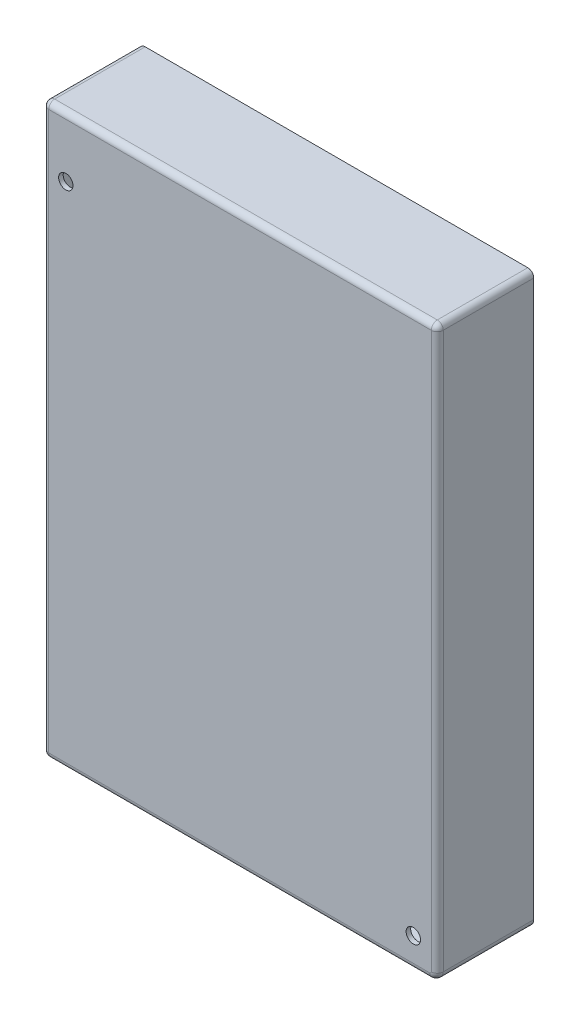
ISO-10303-21;
HEADER;
FILE_DESCRIPTION(('STEP AP214'),'2;1');
FILE_NAME('part.step','',(''),(''),'','','');
FILE_SCHEMA(('AUTOMOTIVE_DESIGN { 1 0 10303 214 1 1 1 1 }'));
ENDSEC;
DATA;
#1=APPLICATION_CONTEXT('core data for automotive mechanical design processes');
#2=APPLICATION_PROTOCOL_DEFINITION('international standard','automotive_design',2000,#1);
#3=PRODUCT_CONTEXT('',#1,'mechanical');
#4=PRODUCT('Part','Part','',(#3));
#5=PRODUCT_RELATED_PRODUCT_CATEGORY('part','',(#4));
#6=PRODUCT_DEFINITION_FORMATION('','',#4);
#7=PRODUCT_DEFINITION_CONTEXT('part definition',#1,'design');
#8=PRODUCT_DEFINITION('design','',#6,#7);
#9=PRODUCT_DEFINITION_SHAPE('','',#8);
#10=(LENGTH_UNIT() NAMED_UNIT(*) SI_UNIT(.MILLI.,.METRE.));
#11=(NAMED_UNIT(*) PLANE_ANGLE_UNIT() SI_UNIT($,.RADIAN.));
#12=(NAMED_UNIT(*) SI_UNIT($,.STERADIAN.) SOLID_ANGLE_UNIT());
#13=UNCERTAINTY_MEASURE_WITH_UNIT(LENGTH_MEASURE(1.E-05),#10,'distance_accuracy_value','');
#14=(GEOMETRIC_REPRESENTATION_CONTEXT(3) GLOBAL_UNCERTAINTY_ASSIGNED_CONTEXT((#13)) GLOBAL_UNIT_ASSIGNED_CONTEXT((#10,
#11,#12)) REPRESENTATION_CONTEXT('',''));
#15=CARTESIAN_POINT('',(0.,0.,0.));
#16=DIRECTION('',(0.,0.,1.));
#17=DIRECTION('',(1.,0.,0.));
#18=AXIS2_PLACEMENT_3D('',#15,#16,#17);
#19=CARTESIAN_POINT('',(-262.047880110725,-138.35456356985,37.759));
#20=DIRECTION('',(1.,0.,0.));
#21=DIRECTION('',(0.,1.,0.));
#22=AXIS2_PLACEMENT_3D('',#19,#20,#21);
#23=SPHERICAL_SURFACE('',#22,2.5);
#24=CARTESIAN_POINT('',(-262.047880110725,-138.35456356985,37.759));
#25=DIRECTION('',(0.,0.,1.));
#26=DIRECTION('',(1.,0.,0.));
#27=AXIS2_PLACEMENT_3D('',#24,#25,#26);
#28=CIRCLE('',#27,2.5);
#29=CARTESIAN_POINT('',(-262.047880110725,-140.85456356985,37.759));
#30=VERTEX_POINT('',#29);
#31=CARTESIAN_POINT('',(-264.547880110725,-138.35456356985,37.759));
#32=VERTEX_POINT('',#31);
#33=EDGE_CURVE('E601',#30,#32,#28,.F.);
#34=ORIENTED_EDGE('',*,*,#33,.F.);
#35=CARTESIAN_POINT('',(-262.047880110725,-138.35456356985,37.759));
#36=DIRECTION('',(-1.,0.,0.));
#37=DIRECTION('',(0.,0.,1.));
#38=AXIS2_PLACEMENT_3D('',#35,#36,#37);
#39=CIRCLE('',#38,2.5);
#40=CARTESIAN_POINT('',(-262.047880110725,-138.35456356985,40.259));
#41=VERTEX_POINT('',#40);
#42=EDGE_CURVE('E599',#41,#30,#39,.F.);
#43=ORIENTED_EDGE('',*,*,#42,.F.);
#44=CARTESIAN_POINT('',(-262.047880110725,-138.35456356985,37.759));
#45=DIRECTION('',(0.,1.,0.));
#46=DIRECTION('',(0.,0.,1.));
#47=AXIS2_PLACEMENT_3D('',#44,#45,#46);
#48=CIRCLE('',#47,2.5);
#49=EDGE_CURVE('E72',#32,#41,#48,.T.);
#50=ORIENTED_EDGE('',*,*,#49,.F.);
#51=EDGE_LOOP('',(#34,#43,#50));
#52=FACE_BOUND('',#51,.T.);
#53=ADVANCED_FACE('F15',(#52),#23,.T.);
#54=CARTESIAN_POINT('',(-103.103844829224,-137.67956356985,37.759));
#55=DIRECTION('',(0.,0.,1.));
#56=DIRECTION('',(0.,-1.,0.));
#57=AXIS2_PLACEMENT_3D('',#54,#55,#56);
#58=DEGENERATE_TOROIDAL_SURFACE('',#57,0.674999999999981,2.50000000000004,.T.);
#59=CARTESIAN_POINT('',(-102.428844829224,-137.67956356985,37.759));
#60=DIRECTION('',(0.,-1.,0.));
#61=DIRECTION('',(1.,0.,0.));
#62=AXIS2_PLACEMENT_3D('',#59,#60,#61);
#63=CIRCLE('',#62,2.5);
#64=CARTESIAN_POINT('',(-102.428844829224,-137.67956356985,40.259));
#65=VERTEX_POINT('',#64);
#66=CARTESIAN_POINT('',(-99.9288448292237,-137.67956356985,37.759));
#67=VERTEX_POINT('',#66);
#68=EDGE_CURVE('E636',#65,#67,#63,.F.);
#69=ORIENTED_EDGE('',*,*,#68,.F.);
#70=CARTESIAN_POINT('',(-103.103844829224,-137.67956356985,40.259));
#71=DIRECTION('',(0.,0.,1.));
#72=DIRECTION('',(0.,-1.,0.));
#73=AXIS2_PLACEMENT_3D('',#70,#71,#72);
#74=CIRCLE('',#73,0.675000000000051);
#75=CARTESIAN_POINT('',(-103.103844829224,-138.35456356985,40.259));
#76=VERTEX_POINT('',#75);
#77=EDGE_CURVE('E22',#65,#76,#74,.F.);
#78=ORIENTED_EDGE('',*,*,#77,.T.);
#79=CARTESIAN_POINT('',(-103.103844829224,-138.35456356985,37.759));
#80=DIRECTION('',(-1.,0.,0.));
#81=DIRECTION('',(0.,0.,1.));
#82=AXIS2_PLACEMENT_3D('',#79,#80,#81);
#83=CIRCLE('',#82,2.5);
#84=CARTESIAN_POINT('',(-103.103844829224,-140.85456356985,37.759));
#85=VERTEX_POINT('',#84);
#86=EDGE_CURVE('E637',#85,#76,#83,.T.);
#87=ORIENTED_EDGE('',*,*,#86,.F.);
#88=CARTESIAN_POINT('',(-103.103844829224,-137.67956356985,37.759));
#89=DIRECTION('',(0.,0.,1.));
#90=DIRECTION('',(1.,0.,0.));
#91=AXIS2_PLACEMENT_3D('',#88,#89,#90);
#92=CIRCLE('',#91,3.175);
#93=EDGE_CURVE('E283',#67,#85,#92,.F.);
#94=ORIENTED_EDGE('',*,*,#93,.F.);
#95=EDGE_LOOP('',(#69,#78,#87,#94));
#96=FACE_BOUND('',#95,.T.);
#97=ADVANCED_FACE('F576',(#96),#58,.T.);
#98=CARTESIAN_POINT('',(-102.42884482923,94.1454364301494,40.259));
#99=CARTESIAN_POINT('',(-102.42884482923,94.1454364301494,40.259));
#100=CARTESIAN_POINT('',(-102.42884482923,94.1454364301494,40.259));
#101=CARTESIAN_POINT('',(-102.42884482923,94.1454364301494,40.259));
#102=CARTESIAN_POINT('',(-102.42884482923,94.1454364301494,40.259));
#103=CARTESIAN_POINT('',(-102.42884482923,94.1454364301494,40.259));
#104=CARTESIAN_POINT('',(-102.42884482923,94.1454364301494,40.259));
#105=CARTESIAN_POINT('',(-102.42884482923,94.1454364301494,40.259));
#106=CARTESIAN_POINT('',(-102.42884482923,94.1454364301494,40.259));
#107=CARTESIAN_POINT('',(-102.42884482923,94.1454364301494,40.259));
#108=CARTESIAN_POINT('',(-102.054845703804,94.1470521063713,40.259000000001));
#109=CARTESIAN_POINT('',(-102.072578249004,94.1647846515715,40.2590000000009));
#110=CARTESIAN_POINT('',(-102.108043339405,94.2002497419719,40.2590000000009));
#111=CARTESIAN_POINT('',(-102.161240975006,94.2534473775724,40.2590000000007));
#112=CARTESIAN_POINT('',(-102.214438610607,94.306645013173,40.2590000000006));
#113=CARTESIAN_POINT('',(-102.267636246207,94.3598426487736,40.2590000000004));
#114=CARTESIAN_POINT('',(-102.320833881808,94.4130402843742,40.2590000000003));
#115=CARTESIAN_POINT('',(-102.374031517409,94.4662379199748,40.2590000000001));
#116=CARTESIAN_POINT('',(-102.409496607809,94.5017030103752,40.2590000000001));
#117=CARTESIAN_POINT('',(-102.42722915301,94.5194355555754,40.259));
#118=CARTESIAN_POINT('',(-101.306951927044,94.1502830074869,40.0882066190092));
#119=CARTESIAN_POINT('',(-101.360317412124,94.2032629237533,40.1059088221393));
#120=CARTESIAN_POINT('',(-101.467110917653,94.3092165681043,40.1360134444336));
#121=CARTESIAN_POINT('',(-101.627226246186,94.4682851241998,40.1658072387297));
#122=CARTESIAN_POINT('',(-101.787131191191,94.6275642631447,40.1806094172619));
#123=CARTESIAN_POINT('',(-101.946706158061,94.787163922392,40.1806099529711));
#124=CARTESIAN_POINT('',(-102.106004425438,94.9470409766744,40.1658066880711));
#125=CARTESIAN_POINT('',(-102.265058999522,95.1071852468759,40.1360139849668));
#126=CARTESIAN_POINT('',(-102.37101887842,95.2139639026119,40.1059087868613));
#127=CARTESIAN_POINT('',(-102.423998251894,95.2673293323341,40.0882066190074));
#128=CARTESIAN_POINT('',(-100.55757465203,94.153520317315,39.490416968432));
#129=CARTESIAN_POINT('',(-100.61230535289,94.2598817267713,39.5493723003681));
#130=CARTESIAN_POINT('',(-100.735613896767,94.4725948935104,39.6518939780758));
#131=CARTESIAN_POINT('',(-100.95743914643,94.7849828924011,39.7562715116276));
#132=CARTESIAN_POINT('',(-101.210925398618,95.0840276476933,39.809013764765));
#133=CARTESIAN_POINT('',(-101.490235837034,95.363378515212,39.8090155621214));
#134=CARTESIAN_POINT('',(-101.789311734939,95.6168191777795,39.7562702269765));
#135=CARTESIAN_POINT('',(-102.101677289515,95.8386917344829,39.6518950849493));
#136=CARTESIAN_POINT('',(-102.314400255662,95.9619759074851,39.5493724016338));
#137=CARTESIAN_POINT('',(-102.420760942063,96.0167066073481,39.4904169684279));
#138=CARTESIAN_POINT('',(-100.15753550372,94.1552484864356,38.852699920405));
#139=CARTESIAN_POINT('',(-100.186236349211,94.3064699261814,38.9154581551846));
#140=CARTESIAN_POINT('',(-100.273180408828,94.608900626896,39.0260016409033));
#141=CARTESIAN_POINT('',(-100.486817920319,95.0450934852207,39.1403664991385));
#142=CARTESIAN_POINT('',(-100.775338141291,95.4469348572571,39.1987020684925));
#143=CARTESIAN_POINT('',(-101.127321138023,95.7989750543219,39.1987048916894));
#144=CARTESIAN_POINT('',(-101.529205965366,96.0874313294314,39.1403647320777));
#145=CARTESIAN_POINT('',(-101.965368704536,96.3011346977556,39.0260029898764));
#146=CARTESIAN_POINT('',(-102.267811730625,96.3880448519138,38.9154584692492));
#147=CARTESIAN_POINT('',(-102.419032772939,96.4167457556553,38.8526999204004));
#148=CARTESIAN_POINT('',(-99.9708912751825,94.1560547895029,38.3200232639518));
#149=CARTESIAN_POINT('',(-99.9777474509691,94.3347209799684,38.3616788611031));
#150=CARTESIAN_POINT('',(-100.030791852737,94.6920410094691,38.4355481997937));
#151=CARTESIAN_POINT('',(-100.224289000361,95.202500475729,38.5126151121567));
#152=CARTESIAN_POINT('',(-100.52257974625,95.6630238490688,38.5521183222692));
#153=CARTESIAN_POINT('',(-100.9112291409,96.0517370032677,38.552120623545));
#154=CARTESIAN_POINT('',(-101.371800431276,96.3499570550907,38.5126137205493));
#155=CARTESIAN_POINT('',(-101.882227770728,96.543526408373,38.4355492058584));
#156=CARTESIAN_POINT('',(-102.239560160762,96.5965337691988,38.3616791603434));
#157=CARTESIAN_POINT('',(-102.418226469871,96.6033899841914,38.3200232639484));
#158=CARTESIAN_POINT('',(-99.9288448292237,94.1562364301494,37.9459995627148));
#159=CARTESIAN_POINT('',(-99.9288448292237,94.3424281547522,37.9599282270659));
#160=CARTESIAN_POINT('',(-99.9708308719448,94.7147956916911,37.984641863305));
#161=CARTESIAN_POINT('',(-100.156425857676,95.2453776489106,38.01044232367));
#162=CARTESIAN_POINT('',(-100.455531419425,95.7212901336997,38.0236726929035));
#163=CARTESIAN_POINT('',(-100.852955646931,96.1187944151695,38.0236732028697));
#164=CARTESIAN_POINT('',(-101.328928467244,96.4178111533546,38.0104420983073));
#165=CARTESIAN_POINT('',(-101.859469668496,96.6034968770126,37.9846419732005));
#166=CARTESIAN_POINT('',(-102.231853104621,96.6454364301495,37.9599283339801));
#167=CARTESIAN_POINT('',(-102.418044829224,96.6454364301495,37.9459995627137));
#168=CARTESIAN_POINT('',(-99.9288448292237,94.1562364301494,37.759));
#169=CARTESIAN_POINT('',(-99.9288448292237,94.3424281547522,37.759));
#170=CARTESIAN_POINT('',(-99.9708308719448,94.7147956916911,37.759));
#171=CARTESIAN_POINT('',(-100.156425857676,95.2453776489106,37.759));
#172=CARTESIAN_POINT('',(-100.455531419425,95.7212901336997,37.759));
#173=CARTESIAN_POINT('',(-100.852955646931,96.1187944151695,37.759));
#174=CARTESIAN_POINT('',(-101.328928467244,96.4178111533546,37.759));
#175=CARTESIAN_POINT('',(-101.859469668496,96.6034968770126,37.759));
#176=CARTESIAN_POINT('',(-102.231853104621,96.6454364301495,37.759));
#177=CARTESIAN_POINT('',(-102.418044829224,96.6454364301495,37.759));
#178=B_SPLINE_SURFACE_WITH_KNOTS('',3,3,((#98,#99,#100,#101,#102,#103,#104,#105,#106,#107),
(#108,#109,#110,#111,#112,#113,#114,#115,#116,#117),(#118,#119,#120,#121,#122,#123,#124,#125,
#126,#127),(#128,#129,#130,#131,#132,#133,#134,#135,#136,#137),(#138,#139,#140,#141,#142,#143,
#144,#145,#146,#147),(#148,#149,#150,#151,#152,#153,#154,#155,#156,#157),(#158,#159,#160,#161,
#162,#163,#164,#165,#166,#167),(#168,#169,#170,#171,#172,#173,#174,#175,#176,#177)),
.UNSPECIFIED.,.F.,.F.,.F.,(4,1,1,1,1,4),(4,1,1,1,1,1,1,4),(-1.57079632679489,-1.12199737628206,
-0.673198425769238,-0.448798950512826,-0.224399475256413,0.),(0.,0.142857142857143,
0.285714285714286,0.428571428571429,0.571428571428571,0.714285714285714,0.857142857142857,1.),.UNSPECIFIED.);
#179=CARTESIAN_POINT('',(-102.418044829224,96.6454364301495,37.759));
#180=CARTESIAN_POINT('',(-102.418044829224,96.6454364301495,37.9459995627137));
#181=CARTESIAN_POINT('',(-102.418226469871,96.6033899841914,38.3200232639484));
#182=CARTESIAN_POINT('',(-102.419032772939,96.4167457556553,38.8526999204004));
#183=CARTESIAN_POINT('',(-102.420760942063,96.0167066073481,39.4904169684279));
#184=CARTESIAN_POINT('',(-102.423998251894,95.2673293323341,40.0882066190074));
#185=CARTESIAN_POINT('',(-102.42722915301,94.5194355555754,40.259));
#186=CARTESIAN_POINT('',(-102.42884482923,94.1454364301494,40.259));
#187=B_SPLINE_CURVE_WITH_KNOTS('',3,(#179,#180,#181,#182,#183,#184,#185,#186),.UNSPECIFIED.,.F.,
.F.,(4,1,1,1,1,4),(-1.57079632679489,-1.34639685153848,-1.12199737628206,-0.897597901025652,
-0.448798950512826,0.),.UNSPECIFIED.);
#188=CARTESIAN_POINT('',(-102.428844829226,94.1454364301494,40.259));
#189=VERTEX_POINT('',#188);
#190=CARTESIAN_POINT('',(-102.418044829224,96.6454364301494,37.759));
#191=VERTEX_POINT('',#190);
#192=EDGE_CURVE('E203',#189,#191,#187,.F.);
#193=CARTESIAN_POINT('',(-102.42884482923,94.1454364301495,40.259));
#194=CARTESIAN_POINT('',(-102.054845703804,94.1470521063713,40.259000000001));
#195=CARTESIAN_POINT('',(-101.306951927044,94.1502830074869,40.0882066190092));
#196=CARTESIAN_POINT('',(-100.55757465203,94.153520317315,39.490416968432));
#197=CARTESIAN_POINT('',(-100.15753550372,94.1552484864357,38.852699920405));
#198=CARTESIAN_POINT('',(-99.9708912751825,94.156054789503,38.3200232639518));
#199=CARTESIAN_POINT('',(-99.9288448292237,94.1562364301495,37.9459995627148));
#200=CARTESIAN_POINT('',(-99.9288448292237,94.1562364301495,37.759));
#201=B_SPLINE_CURVE_WITH_KNOTS('',3,(#193,#194,#195,#196,#197,#198,#199,#200),.UNSPECIFIED.,.F.,
.F.,(4,1,1,1,1,4),(-1.57079632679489,-1.12199737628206,-0.673198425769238,-0.448798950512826,
-0.224399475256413,0.),.UNSPECIFIED.);
#202=CARTESIAN_POINT('',(-99.9288448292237,94.1562364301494,37.759));
#203=VERTEX_POINT('',#202);
#204=EDGE_CURVE('E217',#203,#189,#201,.F.);
#205=CARTESIAN_POINT('',(-99.9288448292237,94.1562364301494,37.759));
#206=CARTESIAN_POINT('',(-99.9288448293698,94.2027844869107,37.759));
#207=CARTESIAN_POINT('',(-99.9301568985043,94.2493319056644,37.759));
#208=CARTESIAN_POINT('',(-99.9353877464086,94.3422803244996,37.759));
#209=CARTESIAN_POINT('',(-99.9393065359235,94.3886813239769,37.759));
#210=CARTESIAN_POINT('',(-99.9497333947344,94.4811913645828,37.759));
#211=CARTESIAN_POINT('',(-99.9562414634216,94.5273004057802,37.759));
#212=CARTESIAN_POINT('',(-99.9718295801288,94.6190815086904,37.759));
#213=CARTESIAN_POINT('',(-99.9809096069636,94.6647535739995,37.759));
#214=CARTESIAN_POINT('',(-100.00162416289,94.7555149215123,37.759));
#215=CARTESIAN_POINT('',(-100.013258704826,94.8006042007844,37.759));
#216=CARTESIAN_POINT('',(-100.039034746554,94.8900607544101,37.759));
#217=CARTESIAN_POINT('',(-100.053176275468,94.9344280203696,37.759));
#218=CARTESIAN_POINT('',(-100.083918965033,95.022301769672,37.759));
#219=CARTESIAN_POINT('',(-100.10052011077,95.0658082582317,37.759));
#220=CARTESIAN_POINT('',(-100.136134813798,95.1518216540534,37.759));
#221=CARTESIAN_POINT('',(-100.155148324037,95.1943285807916,37.759));
#222=CARTESIAN_POINT('',(-100.195540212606,95.2782034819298,37.759));
#223=CARTESIAN_POINT('',(-100.216918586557,95.3195714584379,37.759));
#224=CARTESIAN_POINT('',(-100.261960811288,95.4010445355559,37.759));
#225=CARTESIAN_POINT('',(-100.285624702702,95.4411496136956,37.759));
#226=CARTESIAN_POINT('',(-100.335158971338,95.5199735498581,37.759));
#227=CARTESIAN_POINT('',(-100.361029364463,95.5586923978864,37.759));
#228=CARTESIAN_POINT('',(-100.414897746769,95.6346204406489,37.759));
#229=CARTESIAN_POINT('',(-100.442895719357,95.6718296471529,37.759));
#230=CARTESIAN_POINT('',(-100.500939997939,95.7446145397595,37.759));
#231=CARTESIAN_POINT('',(-100.530986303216,95.7801902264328,37.759));
#232=CARTESIAN_POINT('',(-100.593024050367,95.8496033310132,37.759));
#233=CARTESIAN_POINT('',(-100.625015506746,95.8834407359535,37.759));
#234=CARTESIAN_POINT('',(-100.69084079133,95.9492729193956,37.759));
#235=CARTESIAN_POINT('',(-100.724674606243,95.9812677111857,37.759));
#236=CARTESIAN_POINT('',(-100.794081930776,96.0433102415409,37.759));
#237=CARTESIAN_POINT('',(-100.829655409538,96.0733580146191,37.759));
#238=CARTESIAN_POINT('',(-100.90243881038,96.1314016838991,37.759));
#239=CARTESIAN_POINT('',(-100.939648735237,96.159397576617,37.759));
#240=CARTESIAN_POINT('',(-101.015579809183,96.2132600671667,37.759));
#241=CARTESIAN_POINT('',(-101.054300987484,96.2391266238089,37.759));
#242=CARTESIAN_POINT('',(-101.133129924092,96.2886533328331,37.759));
#243=CARTESIAN_POINT('',(-101.173237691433,96.3123134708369,37.759));
#244=CARTESIAN_POINT('',(-101.254715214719,96.3573501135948,37.759));
#245=CARTESIAN_POINT('',(-101.296084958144,96.3787266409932,37.759));
#246=CARTESIAN_POINT('',(-101.379961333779,96.4191186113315,37.759));
#247=CARTESIAN_POINT('',(-101.4224679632,96.4381340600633,37.759));
#248=CARTESIAN_POINT('',(-101.508479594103,96.4737546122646,37.759));
#249=CARTESIAN_POINT('',(-101.551984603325,96.4903596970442,37.759));
#250=CARTESIAN_POINT('',(-101.639855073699,96.5211104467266,37.759));
#251=CARTESIAN_POINT('',(-101.684220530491,96.5352561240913,37.759));
#252=CARTESIAN_POINT('',(-101.77367401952,96.5610388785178,37.759));
#253=CARTESIAN_POINT('',(-101.818762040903,96.5726759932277,37.759));
#254=CARTESIAN_POINT('',(-101.909522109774,96.5933923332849,37.759));
#255=CARTESIAN_POINT('',(-101.955194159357,96.602471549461,37.759));
#256=CARTESIAN_POINT('',(-102.0469759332,96.6180562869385,37.759));
#257=CARTESIAN_POINT('',(-102.09308566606,96.6245617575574,37.759));
#258=CARTESIAN_POINT('',(-102.185597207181,96.6349832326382,37.759));
#259=CARTESIAN_POINT('',(-102.231999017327,96.6388992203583,37.759));
#260=CARTESIAN_POINT('',(-102.324948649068,96.6441257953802,37.759));
#261=CARTESIAN_POINT('',(-102.371496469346,96.6454364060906,37.759));
#262=CARTESIAN_POINT('',(-102.418044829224,96.6454364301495,37.759));
#263=B_SPLINE_CURVE_WITH_KNOTS('',3,(#205,#206,#207,#208,#209,#210,#211,#212,#213,#214,#215,
#216,#217,#218,#219,#220,#221,#222,#223,#224,#225,#226,#227,#228,#229,#230,#231,#232,#233,#234,
#235,#236,#237,#238,#239,#240,#241,#242,#243,#244,#245,#246,#247,#248,#249,#250,#251,#252,#253,
#254,#255,#256,#257,#258,#259,#260,#261,#262),.UNSPECIFIED.,.F.,.F.,(4,2,2,2,2,2,2,2,2,2,2,2,2,
2,2,2,2,2,2,2,2,2,2,2,2,2,2,2,4),(0.,0.139624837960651,0.279250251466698,0.418875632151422,
0.558499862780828,0.698124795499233,0.837751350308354,0.977377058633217,1.11700004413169,
1.2566227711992,1.39624798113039,1.53587419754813,1.67549932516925,1.81512440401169,
1.95475052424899,2.09437563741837,2.23399827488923,2.37362114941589,2.51324672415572,
2.65287320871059,2.79249830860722,2.93212306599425,3.07174890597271,3.21137403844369,
3.35099707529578,3.49062061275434,3.63024689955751,3.76987408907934,3.90950002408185),.UNSPECIFIED.);
#264=EDGE_CURVE('E171',#191,#203,#263,.F.);
#265=ORIENTED_EDGE('',*,*,#192,.F.);
#266=ORIENTED_EDGE('',*,*,#204,.F.);
#267=ORIENTED_EDGE('',*,*,#264,.F.);
#268=EDGE_LOOP('',(#265,#266,#267));
#269=FACE_BOUND('',#268,.T.);
#270=ADVANCED_FACE('F17',(#269),#178,.T.);
#271=CARTESIAN_POINT('',(-262.047880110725,94.1454364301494,37.759));
#272=DIRECTION('',(1.,0.,0.));
#273=DIRECTION('',(0.,1.,0.));
#274=AXIS2_PLACEMENT_3D('',#271,#272,#273);
#275=SPHERICAL_SURFACE('',#274,2.5);
#276=CARTESIAN_POINT('',(-262.047880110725,94.1454364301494,37.759));
#277=DIRECTION('',(0.,0.,1.));
#278=DIRECTION('',(1.,0.,0.));
#279=AXIS2_PLACEMENT_3D('',#276,#277,#278);
#280=CIRCLE('',#279,2.49999999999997);
#281=CARTESIAN_POINT('',(-264.547880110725,94.1454364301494,37.759));
#282=VERTEX_POINT('',#281);
#283=CARTESIAN_POINT('',(-262.047880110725,96.6454364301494,37.759));
#284=VERTEX_POINT('',#283);
#285=EDGE_CURVE('E604',#282,#284,#280,.F.);
#286=ORIENTED_EDGE('',*,*,#285,.F.);
#287=CARTESIAN_POINT('',(-262.047880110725,94.1454364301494,37.759));
#288=DIRECTION('',(0.,1.,0.));
#289=DIRECTION('',(0.,0.,1.));
#290=AXIS2_PLACEMENT_3D('',#287,#288,#289);
#291=CIRCLE('',#290,2.5);
#292=CARTESIAN_POINT('',(-262.047880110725,94.1454364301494,40.259));
#293=VERTEX_POINT('',#292);
#294=EDGE_CURVE('E600',#293,#282,#291,.F.);
#295=ORIENTED_EDGE('',*,*,#294,.F.);
#296=CARTESIAN_POINT('',(-262.047880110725,94.1454364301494,37.759));
#297=DIRECTION('',(1.,0.,0.));
#298=DIRECTION('',(0.,1.,0.));
#299=AXIS2_PLACEMENT_3D('',#296,#297,#298);
#300=CIRCLE('',#299,2.5);
#301=EDGE_CURVE('E191',#284,#293,#300,.T.);
#302=ORIENTED_EDGE('',*,*,#301,.F.);
#303=EDGE_LOOP('',(#286,#295,#302));
#304=FACE_BOUND('',#303,.T.);
#305=ADVANCED_FACE('F561',(#304),#275,.T.);
#306=CARTESIAN_POINT('',(-103.103844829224,-140.85456356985,0.));
#307=DIRECTION('',(0.,-1.,0.));
#308=DIRECTION('',(0.,0.,-1.));
#309=AXIS2_PLACEMENT_3D('',#306,#307,#308);
#310=PLANE('',#309);
#311=DIRECTION('',(1.,0.,0.));
#312=VECTOR('',#311,1.);
#313=CARTESIAN_POINT('',(-182.268140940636,-140.85456356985,0.));
#314=LINE('',#313,#312);
#315=CARTESIAN_POINT('',(-262.047880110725,-140.85456356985,0.));
#316=VERTEX_POINT('',#315);
#317=CARTESIAN_POINT('',(-103.103844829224,-140.85456356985,0.));
#318=VERTEX_POINT('',#317);
#319=EDGE_CURVE('E184',#316,#318,#314,.T.);
#320=ORIENTED_EDGE('',*,*,#319,.T.);
#321=DIRECTION('',(0.,0.,1.));
#322=VECTOR('',#321,1.);
#323=CARTESIAN_POINT('',(-103.103844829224,-140.85456356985,0.));
#324=LINE('',#323,#322);
#325=EDGE_CURVE('E157',#85,#318,#324,.F.);
#326=ORIENTED_EDGE('',*,*,#325,.F.);
#327=DIRECTION('',(-1.,0.,0.));
#328=VECTOR('',#327,1.);
#329=CARTESIAN_POINT('',(-142.68599288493,-140.85456356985,37.759));
#330=LINE('',#329,#328);
#331=EDGE_CURVE('E595',#30,#85,#330,.F.);
#332=ORIENTED_EDGE('',*,*,#331,.F.);
#333=DIRECTION('',(0.,0.,1.));
#334=VECTOR('',#333,1.);
#335=CARTESIAN_POINT('',(-262.047880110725,-140.85456356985,0.));
#336=LINE('',#335,#334);
#337=EDGE_CURVE('E643',#316,#30,#336,.T.);
#338=ORIENTED_EDGE('',*,*,#337,.F.);
#339=EDGE_LOOP('',(#320,#326,#332,#338));
#340=FACE_BOUND('',#339,.T.);
#341=ADVANCED_FACE('F555',(#340),#310,.T.);
#342=CARTESIAN_POINT('',(-103.103844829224,-137.67956356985,0.));
#343=DIRECTION('',(0.,0.,1.));
#344=DIRECTION('',(1.,0.,0.));
#345=AXIS2_PLACEMENT_3D('',#342,#343,#344);
#346=CYLINDRICAL_SURFACE('',#345,3.175);
#347=CARTESIAN_POINT('',(-103.103844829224,-137.67956356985,0.));
#348=DIRECTION('',(0.,0.,1.));
#349=DIRECTION('',(1.,0.,0.));
#350=AXIS2_PLACEMENT_3D('',#347,#348,#349);
#351=CIRCLE('',#350,3.175);
#352=CARTESIAN_POINT('',(-99.9288448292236,-137.67956356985,0.));
#353=VERTEX_POINT('',#352);
#354=EDGE_CURVE('E177',#318,#353,#351,.T.);
#355=ORIENTED_EDGE('',*,*,#354,.T.);
#356=DIRECTION('',(0.,0.,-1.));
#357=VECTOR('',#356,1.);
#358=CARTESIAN_POINT('',(-99.9288448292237,-137.67956356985,0.));
#359=LINE('',#358,#357);
#360=EDGE_CURVE('E164',#67,#353,#359,.T.);
#361=ORIENTED_EDGE('',*,*,#360,.F.);
#362=ORIENTED_EDGE('',*,*,#93,.T.);
#363=ORIENTED_EDGE('',*,*,#325,.T.);
#364=EDGE_LOOP('',(#355,#361,#362,#363));
#365=FACE_BOUND('',#364,.T.);
#366=ADVANCED_FACE('F183',(#365),#346,.T.);
#367=CARTESIAN_POINT('',(-99.9288448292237,94.1562364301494,0.));
#368=DIRECTION('',(1.,0.,0.));
#369=DIRECTION('',(0.,0.,-1.));
#370=AXIS2_PLACEMENT_3D('',#367,#368,#369);
#371=PLANE('',#370);
#372=DIRECTION('',(0.,1.,0.));
#373=VECTOR('',#372,1.);
#374=CARTESIAN_POINT('',(-99.9288448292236,-22.0604050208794,0.));
#375=LINE('',#374,#373);
#376=CARTESIAN_POINT('',(-99.9288448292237,94.1562364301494,0.));
#377=VERTEX_POINT('',#376);
#378=EDGE_CURVE('E168',#353,#377,#375,.T.);
#379=ORIENTED_EDGE('',*,*,#378,.T.);
#380=DIRECTION('',(0.,0.,1.));
#381=VECTOR('',#380,1.);
#382=CARTESIAN_POINT('',(-99.9288448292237,94.1562364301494,0.));
#383=LINE('',#382,#381);
#384=EDGE_CURVE('E608',#203,#377,#383,.F.);
#385=ORIENTED_EDGE('',*,*,#384,.F.);
#386=DIRECTION('',(0.,-1.,0.));
#387=VECTOR('',#386,1.);
#388=CARTESIAN_POINT('',(-99.9288448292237,36.047915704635,37.759));
#389=LINE('',#388,#387);
#390=EDGE_CURVE('E170',#67,#203,#389,.F.);
#391=ORIENTED_EDGE('',*,*,#390,.F.);
#392=ORIENTED_EDGE('',*,*,#360,.T.);
#393=EDGE_LOOP('',(#379,#385,#391,#392));
#394=FACE_BOUND('',#393,.T.);
#395=ADVANCED_FACE('F166',(#394),#371,.T.);
#396=CARTESIAN_POINT('',(-102.418044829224,94.1562364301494,0.));
#397=DIRECTION('',(0.,0.,1.));
#398=DIRECTION('',(1.,0.,0.));
#399=AXIS2_PLACEMENT_3D('',#396,#397,#398);
#400=CYLINDRICAL_SURFACE('',#399,2.4892);
#401=CARTESIAN_POINT('',(-102.418044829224,94.1562364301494,0.));
#402=DIRECTION('',(0.,0.,1.));
#403=DIRECTION('',(1.,0.,0.));
#404=AXIS2_PLACEMENT_3D('',#401,#402,#403);
#405=CIRCLE('',#404,2.4892);
#406=CARTESIAN_POINT('',(-102.418044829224,96.6454364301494,0.));
#407=VERTEX_POINT('',#406);
#408=EDGE_CURVE('E181',#377,#407,#405,.T.);
#409=ORIENTED_EDGE('',*,*,#408,.T.);
#410=DIRECTION('',(0.,0.,1.));
#411=VECTOR('',#410,1.);
#412=CARTESIAN_POINT('',(-102.418044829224,96.6454364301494,0.));
#413=LINE('',#412,#411);
#414=EDGE_CURVE('E606',#191,#407,#413,.F.);
#415=ORIENTED_EDGE('',*,*,#414,.F.);
#416=ORIENTED_EDGE('',*,*,#264,.T.);
#417=ORIENTED_EDGE('',*,*,#384,.T.);
#418=EDGE_LOOP('',(#409,#415,#416,#417));
#419=FACE_BOUND('',#418,.T.);
#420=ADVANCED_FACE('F258',(#419),#400,.T.);
#421=CARTESIAN_POINT('',(-262.047880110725,96.6454364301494,0.));
#422=DIRECTION('',(0.,1.,0.));
#423=DIRECTION('',(0.,0.,1.));
#424=AXIS2_PLACEMENT_3D('',#421,#422,#423);
#425=PLANE('',#424);
#426=DIRECTION('',(1.,0.,0.));
#427=VECTOR('',#426,1.);
#428=CARTESIAN_POINT('',(-182.268140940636,96.6454364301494,0.));
#429=LINE('',#428,#427);
#430=CARTESIAN_POINT('',(-262.047880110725,96.6454364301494,0.));
#431=VERTEX_POINT('',#430);
#432=EDGE_CURVE('E321',#407,#431,#429,.F.);
#433=ORIENTED_EDGE('',*,*,#432,.T.);
#434=DIRECTION('',(0.,0.,1.));
#435=VECTOR('',#434,1.);
#436=CARTESIAN_POINT('',(-262.047880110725,96.6454364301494,0.));
#437=LINE('',#436,#435);
#438=EDGE_CURVE('E605',#284,#431,#437,.F.);
#439=ORIENTED_EDGE('',*,*,#438,.F.);
#440=DIRECTION('',(1.,0.,0.));
#441=VECTOR('',#440,1.);
#442=CARTESIAN_POINT('',(-222.15801052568,96.6454364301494,37.759));
#443=LINE('',#442,#441);
#444=EDGE_CURVE('E196',#191,#284,#443,.F.);
#445=ORIENTED_EDGE('',*,*,#444,.F.);
#446=ORIENTED_EDGE('',*,*,#414,.T.);
#447=EDGE_LOOP('',(#433,#439,#445,#446));
#448=FACE_BOUND('',#447,.T.);
#449=ADVANCED_FACE('F254',(#448),#425,.T.);
#450=CARTESIAN_POINT('',(-262.047880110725,94.1454364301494,0.));
#451=DIRECTION('',(0.,0.,1.));
#452=DIRECTION('',(1.,0.,0.));
#453=AXIS2_PLACEMENT_3D('',#450,#451,#452);
#454=CYLINDRICAL_SURFACE('',#453,2.49999999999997);
#455=CARTESIAN_POINT('',(-262.047880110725,94.1454364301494,0.));
#456=DIRECTION('',(0.,0.,1.));
#457=DIRECTION('',(1.,0.,0.));
#458=AXIS2_PLACEMENT_3D('',#455,#456,#457);
#459=CIRCLE('',#458,2.49999999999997);
#460=CARTESIAN_POINT('',(-264.547880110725,94.1454364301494,0.));
#461=VERTEX_POINT('',#460);
#462=EDGE_CURVE('E319',#431,#461,#459,.T.);
#463=ORIENTED_EDGE('',*,*,#462,.T.);
#464=DIRECTION('',(0.,0.,1.));
#465=VECTOR('',#464,1.);
#466=CARTESIAN_POINT('',(-264.547880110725,94.1454364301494,0.));
#467=LINE('',#466,#465);
#468=EDGE_CURVE('E603',#282,#461,#467,.F.);
#469=ORIENTED_EDGE('',*,*,#468,.F.);
#470=ORIENTED_EDGE('',*,*,#285,.T.);
#471=ORIENTED_EDGE('',*,*,#438,.T.);
#472=EDGE_LOOP('',(#463,#469,#470,#471));
#473=FACE_BOUND('',#472,.T.);
#474=ADVANCED_FACE('F250',(#473),#454,.T.);
#475=CARTESIAN_POINT('',(-264.547880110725,-138.35456356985,0.));
#476=DIRECTION('',(-1.,0.,0.));
#477=DIRECTION('',(0.,0.,1.));
#478=AXIS2_PLACEMENT_3D('',#475,#476,#477);
#479=PLANE('',#478);
#480=DIRECTION('',(0.,1.,0.));
#481=VECTOR('',#480,1.);
#482=CARTESIAN_POINT('',(-264.547880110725,-22.0604050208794,0.));
#483=LINE('',#482,#481);
#484=CARTESIAN_POINT('',(-264.547880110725,-138.35456356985,0.));
#485=VERTEX_POINT('',#484);
#486=EDGE_CURVE('E318',#461,#485,#483,.F.);
#487=ORIENTED_EDGE('',*,*,#486,.T.);
#488=DIRECTION('',(0.,0.,1.));
#489=VECTOR('',#488,1.);
#490=CARTESIAN_POINT('',(-264.547880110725,-138.35456356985,0.));
#491=LINE('',#490,#489);
#492=EDGE_CURVE('E602',#32,#485,#491,.F.);
#493=ORIENTED_EDGE('',*,*,#492,.F.);
#494=DIRECTION('',(0.,1.,0.));
#495=VECTOR('',#494,1.);
#496=CARTESIAN_POINT('',(-264.547880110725,-80.2074842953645,37.759));
#497=LINE('',#496,#495);
#498=EDGE_CURVE('E597',#282,#32,#497,.F.);
#499=ORIENTED_EDGE('',*,*,#498,.F.);
#500=ORIENTED_EDGE('',*,*,#468,.T.);
#501=EDGE_LOOP('',(#487,#493,#499,#500));
#502=FACE_BOUND('',#501,.T.);
#503=ADVANCED_FACE('F246',(#502),#479,.T.);
#504=CARTESIAN_POINT('',(-262.047880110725,-138.35456356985,0.));
#505=DIRECTION('',(0.,0.,1.));
#506=DIRECTION('',(1.,0.,0.));
#507=AXIS2_PLACEMENT_3D('',#504,#505,#506);
#508=CYLINDRICAL_SURFACE('',#507,2.5);
#509=CARTESIAN_POINT('',(-262.047880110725,-138.35456356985,0.));
#510=DIRECTION('',(0.,0.,1.));
#511=DIRECTION('',(1.,0.,0.));
#512=AXIS2_PLACEMENT_3D('',#509,#510,#511);
#513=CIRCLE('',#512,2.5);
#514=EDGE_CURVE('E316',#485,#316,#513,.T.);
#515=ORIENTED_EDGE('',*,*,#514,.T.);
#516=ORIENTED_EDGE('',*,*,#337,.T.);
#517=ORIENTED_EDGE('',*,*,#33,.T.);
#518=ORIENTED_EDGE('',*,*,#492,.T.);
#519=EDGE_LOOP('',(#515,#516,#517,#518));
#520=FACE_BOUND('',#519,.T.);
#521=ADVANCED_FACE('F243',(#520),#508,.T.);
#522=CARTESIAN_POINT('',(-262.047880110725,-80.2074842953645,37.759));
#523=DIRECTION('',(0.,1.,0.));
#524=DIRECTION('',(0.,0.,1.));
#525=AXIS2_PLACEMENT_3D('',#522,#523,#524);
#526=CYLINDRICAL_SURFACE('',#525,2.5);
#527=ORIENTED_EDGE('',*,*,#294,.T.);
#528=ORIENTED_EDGE('',*,*,#498,.T.);
#529=ORIENTED_EDGE('',*,*,#49,.T.);
#530=DIRECTION('',(0.,1.,0.));
#531=VECTOR('',#530,1.);
#532=CARTESIAN_POINT('',(-262.047880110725,-22.0604050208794,40.259));
#533=LINE('',#532,#531);
#534=EDGE_CURVE('E209',#293,#41,#533,.F.);
#535=ORIENTED_EDGE('',*,*,#534,.F.);
#536=EDGE_LOOP('',(#527,#528,#529,#535));
#537=FACE_BOUND('',#536,.T.);
#538=ADVANCED_FACE('F239',(#537),#526,.T.);
#539=CARTESIAN_POINT('',(-142.68599288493,-138.35456356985,37.759));
#540=DIRECTION('',(-1.,0.,0.));
#541=DIRECTION('',(0.,0.,1.));
#542=AXIS2_PLACEMENT_3D('',#539,#540,#541);
#543=CYLINDRICAL_SURFACE('',#542,2.5);
#544=ORIENTED_EDGE('',*,*,#86,.T.);
#545=DIRECTION('',(1.,0.,0.));
#546=VECTOR('',#545,1.);
#547=CARTESIAN_POINT('',(-182.268140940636,-138.35456356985,40.259));
#548=LINE('',#547,#546);
#549=EDGE_CURVE('E211',#41,#76,#548,.T.);
#550=ORIENTED_EDGE('',*,*,#549,.F.);
#551=ORIENTED_EDGE('',*,*,#42,.T.);
#552=ORIENTED_EDGE('',*,*,#331,.T.);
#553=EDGE_LOOP('',(#544,#550,#551,#552));
#554=FACE_BOUND('',#553,.T.);
#555=ADVANCED_FACE('F234',(#554),#543,.T.);
#556=CARTESIAN_POINT('',(-102.428844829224,36.047915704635,37.759));
#557=DIRECTION('',(0.,-1.,0.));
#558=DIRECTION('',(1.,0.,0.));
#559=AXIS2_PLACEMENT_3D('',#556,#557,#558);
#560=CYLINDRICAL_SURFACE('',#559,2.5);
#561=ORIENTED_EDGE('',*,*,#68,.T.);
#562=ORIENTED_EDGE('',*,*,#390,.T.);
#563=ORIENTED_EDGE('',*,*,#204,.T.);
#564=DIRECTION('',(0.,1.,0.));
#565=VECTOR('',#564,1.);
#566=CARTESIAN_POINT('',(-102.428844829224,-22.0604050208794,40.259));
#567=LINE('',#566,#565);
#568=EDGE_CURVE('E356',#65,#189,#567,.T.);
#569=ORIENTED_EDGE('',*,*,#568,.F.);
#570=EDGE_LOOP('',(#561,#562,#563,#569));
#571=FACE_BOUND('',#570,.T.);
#572=ADVANCED_FACE('F223',(#571),#560,.T.);
#573=CARTESIAN_POINT('',(-222.15801052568,94.1454364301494,37.759));
#574=DIRECTION('',(1.,0.,0.));
#575=DIRECTION('',(0.,1.,0.));
#576=AXIS2_PLACEMENT_3D('',#573,#574,#575);
#577=CYLINDRICAL_SURFACE('',#576,2.5);
#578=ORIENTED_EDGE('',*,*,#301,.T.);
#579=DIRECTION('',(1.,0.,0.));
#580=VECTOR('',#579,1.);
#581=CARTESIAN_POINT('',(-182.268140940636,94.1454364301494,40.259));
#582=LINE('',#581,#580);
#583=EDGE_CURVE('E354',#189,#293,#582,.F.);
#584=ORIENTED_EDGE('',*,*,#583,.F.);
#585=ORIENTED_EDGE('',*,*,#192,.T.);
#586=ORIENTED_EDGE('',*,*,#444,.T.);
#587=EDGE_LOOP('',(#578,#584,#585,#586));
#588=FACE_BOUND('',#587,.T.);
#589=ADVANCED_FACE('F233',(#588),#577,.T.);
#590=CARTESIAN_POINT('',(-102.418044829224,94.1562364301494,0.));
#591=DIRECTION('',(0.,0.,1.));
#592=DIRECTION('',(1.,0.,0.));
#593=AXIS2_PLACEMENT_3D('',#590,#591,#592);
#594=CYLINDRICAL_SURFACE('',#593,0.5842);
#595=DIRECTION('',(0.,0.,1.));
#596=VECTOR('',#595,1.);
#597=CARTESIAN_POINT('',(-102.418044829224,94.7404364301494,0.));
#598=LINE('',#597,#596);
#599=CARTESIAN_POINT('',(-102.418044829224,94.7404364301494,38.354));
#600=VERTEX_POINT('',#599);
#601=CARTESIAN_POINT('',(-102.418044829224,94.7404364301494,0.));
#602=VERTEX_POINT('',#601);
#603=EDGE_CURVE('E335',#600,#602,#598,.F.);
#604=ORIENTED_EDGE('',*,*,#603,.T.);
#605=CARTESIAN_POINT('',(-102.418044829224,94.1562364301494,0.));
#606=DIRECTION('',(0.,0.,1.));
#607=DIRECTION('',(1.,0.,0.));
#608=AXIS2_PLACEMENT_3D('',#605,#606,#607);
#609=CIRCLE('',#608,0.5842);
#610=CARTESIAN_POINT('',(-101.833844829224,94.1562364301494,0.));
#611=VERTEX_POINT('',#610);
#612=EDGE_CURVE('E312',#602,#611,#609,.F.);
#613=ORIENTED_EDGE('',*,*,#612,.T.);
#614=DIRECTION('',(0.,0.,-1.));
#615=VECTOR('',#614,1.);
#616=CARTESIAN_POINT('',(-101.833844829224,94.1562364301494,0.));
#617=LINE('',#616,#615);
#618=CARTESIAN_POINT('',(-101.833844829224,94.1562364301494,38.354));
#619=VERTEX_POINT('',#618);
#620=EDGE_CURVE('E339',#611,#619,#617,.F.);
#621=ORIENTED_EDGE('',*,*,#620,.T.);
#622=CARTESIAN_POINT('',(-102.418044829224,94.1562364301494,38.354));
#623=DIRECTION('',(0.,0.,1.));
#624=DIRECTION('',(1.,0.,0.));
#625=AXIS2_PLACEMENT_3D('',#622,#623,#624);
#626=CIRCLE('',#625,0.5842);
#627=EDGE_CURVE('E190',#600,#619,#626,.F.);
#628=ORIENTED_EDGE('',*,*,#627,.F.);
#629=EDGE_LOOP('',(#604,#613,#621,#628));
#630=FACE_BOUND('',#629,.T.);
#631=ADVANCED_FACE('F409',(#630),#594,.F.);
#632=CARTESIAN_POINT('',(-262.047880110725,94.1454364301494,0.));
#633=DIRECTION('',(0.,0.,1.));
#634=DIRECTION('',(1.,0.,0.));
#635=AXIS2_PLACEMENT_3D('',#632,#633,#634);
#636=CYLINDRICAL_SURFACE('',#635,0.594999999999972);
#637=DIRECTION('',(0.,0.,1.));
#638=VECTOR('',#637,1.);
#639=CARTESIAN_POINT('',(-262.642880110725,94.1454364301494,0.));
#640=LINE('',#639,#638);
#641=CARTESIAN_POINT('',(-262.642880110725,94.1454364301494,38.354));
#642=VERTEX_POINT('',#641);
#643=CARTESIAN_POINT('',(-262.642880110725,94.1454364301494,0.));
#644=VERTEX_POINT('',#643);
#645=EDGE_CURVE('E366',#642,#644,#640,.F.);
#646=ORIENTED_EDGE('',*,*,#645,.T.);
#647=CARTESIAN_POINT('',(-262.047880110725,94.1454364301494,0.));
#648=DIRECTION('',(0.,0.,1.));
#649=DIRECTION('',(1.,0.,0.));
#650=AXIS2_PLACEMENT_3D('',#647,#648,#649);
#651=CIRCLE('',#650,0.594999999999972);
#652=CARTESIAN_POINT('',(-262.047880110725,94.7404364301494,0.));
#653=VERTEX_POINT('',#652);
#654=EDGE_CURVE('E314',#644,#653,#651,.F.);
#655=ORIENTED_EDGE('',*,*,#654,.T.);
#656=DIRECTION('',(0.,0.,1.));
#657=VECTOR('',#656,1.);
#658=CARTESIAN_POINT('',(-262.047880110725,94.7404364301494,0.));
#659=LINE('',#658,#657);
#660=CARTESIAN_POINT('',(-262.047880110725,94.7404364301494,38.354));
#661=VERTEX_POINT('',#660);
#662=EDGE_CURVE('E334',#653,#661,#659,.T.);
#663=ORIENTED_EDGE('',*,*,#662,.T.);
#664=CARTESIAN_POINT('',(-262.047880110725,94.1454364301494,38.354));
#665=DIRECTION('',(0.,0.,1.));
#666=DIRECTION('',(1.,0.,0.));
#667=AXIS2_PLACEMENT_3D('',#664,#665,#666);
#668=CIRCLE('',#667,0.594999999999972);
#669=EDGE_CURVE('E37',#642,#661,#668,.F.);
#670=ORIENTED_EDGE('',*,*,#669,.F.);
#671=EDGE_LOOP('',(#646,#655,#663,#670));
#672=FACE_BOUND('',#671,.T.);
#673=ADVANCED_FACE('F415',(#672),#636,.F.);
#674=CARTESIAN_POINT('',(-182.268140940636,-22.0604050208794,0.));
#675=DIRECTION('',(0.,0.,1.));
#676=DIRECTION('',(1.,0.,0.));
#677=AXIS2_PLACEMENT_3D('',#674,#675,#676);
#678=PLANE('',#677);
#679=DIRECTION('',(1.,0.,0.));
#680=VECTOR('',#679,1.);
#681=CARTESIAN_POINT('',(-103.103844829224,-138.94956356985,0.));
#682=LINE('',#681,#680);
#683=CARTESIAN_POINT('',(-262.047880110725,-138.94956356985,0.));
#684=VERTEX_POINT('',#683);
#685=CARTESIAN_POINT('',(-103.103844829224,-138.94956356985,0.));
#686=VERTEX_POINT('',#685);
#687=EDGE_CURVE('E340',#684,#686,#682,.T.);
#688=ORIENTED_EDGE('',*,*,#687,.T.);
#689=CARTESIAN_POINT('',(-103.103844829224,-137.67956356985,0.));
#690=DIRECTION('',(0.,0.,1.));
#691=DIRECTION('',(1.,0.,0.));
#692=AXIS2_PLACEMENT_3D('',#689,#690,#691);
#693=CIRCLE('',#692,1.27);
#694=CARTESIAN_POINT('',(-101.833844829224,-137.67956356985,0.));
#695=VERTEX_POINT('',#694);
#696=EDGE_CURVE('E305',#686,#695,#693,.T.);
#697=ORIENTED_EDGE('',*,*,#696,.T.);
#698=DIRECTION('',(0.,1.,0.));
#699=VECTOR('',#698,1.);
#700=CARTESIAN_POINT('',(-101.833844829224,94.1562364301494,0.));
#701=LINE('',#700,#699);
#702=EDGE_CURVE('E336',#695,#611,#701,.T.);
#703=ORIENTED_EDGE('',*,*,#702,.T.);
#704=ORIENTED_EDGE('',*,*,#612,.F.);
#705=DIRECTION('',(1.,0.,0.));
#706=VECTOR('',#705,1.);
#707=CARTESIAN_POINT('',(-262.047880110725,94.7404364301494,0.));
#708=LINE('',#707,#706);
#709=EDGE_CURVE('E331',#602,#653,#708,.F.);
#710=ORIENTED_EDGE('',*,*,#709,.T.);
#711=ORIENTED_EDGE('',*,*,#654,.F.);
#712=DIRECTION('',(0.,1.,0.));
#713=VECTOR('',#712,1.);
#714=CARTESIAN_POINT('',(-262.642880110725,-138.35456356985,0.));
#715=LINE('',#714,#713);
#716=CARTESIAN_POINT('',(-262.642880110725,-138.35456356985,0.));
#717=VERTEX_POINT('',#716);
#718=EDGE_CURVE('E364',#644,#717,#715,.F.);
#719=ORIENTED_EDGE('',*,*,#718,.T.);
#720=CARTESIAN_POINT('',(-262.047880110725,-138.35456356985,0.));
#721=DIRECTION('',(0.,0.,1.));
#722=DIRECTION('',(1.,0.,0.));
#723=AXIS2_PLACEMENT_3D('',#720,#721,#722);
#724=CIRCLE('',#723,0.595);
#725=EDGE_CURVE('E310',#717,#684,#724,.T.);
#726=ORIENTED_EDGE('',*,*,#725,.T.);
#727=EDGE_LOOP('',(#688,#697,#703,#704,#710,#711,#719,#726));
#728=FACE_BOUND('',#727,.T.);
#729=ORIENTED_EDGE('',*,*,#486,.F.);
#730=ORIENTED_EDGE('',*,*,#462,.F.);
#731=ORIENTED_EDGE('',*,*,#432,.F.);
#732=ORIENTED_EDGE('',*,*,#408,.F.);
#733=ORIENTED_EDGE('',*,*,#378,.F.);
#734=ORIENTED_EDGE('',*,*,#354,.F.);
#735=ORIENTED_EDGE('',*,*,#319,.F.);
#736=ORIENTED_EDGE('',*,*,#514,.F.);
#737=EDGE_LOOP('',(#729,#730,#731,#732,#733,#734,#735,#736));
#738=FACE_BOUND('',#737,.T.);
#739=ADVANCED_FACE('F176',(#728,#738),#678,.F.);
#740=CARTESIAN_POINT('',(-262.047880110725,-138.35456356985,0.));
#741=DIRECTION('',(0.,0.,1.));
#742=DIRECTION('',(1.,0.,0.));
#743=AXIS2_PLACEMENT_3D('',#740,#741,#742);
#744=CYLINDRICAL_SURFACE('',#743,0.595);
#745=DIRECTION('',(0.,0.,-1.));
#746=VECTOR('',#745,1.);
#747=CARTESIAN_POINT('',(-262.047880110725,-138.94956356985,0.));
#748=LINE('',#747,#746);
#749=CARTESIAN_POINT('',(-262.047880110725,-138.94956356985,38.354));
#750=VERTEX_POINT('',#749);
#751=EDGE_CURVE('E342',#750,#684,#748,.T.);
#752=ORIENTED_EDGE('',*,*,#751,.T.);
#753=ORIENTED_EDGE('',*,*,#725,.F.);
#754=DIRECTION('',(0.,0.,1.));
#755=VECTOR('',#754,1.);
#756=CARTESIAN_POINT('',(-262.642880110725,-138.35456356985,0.));
#757=LINE('',#756,#755);
#758=CARTESIAN_POINT('',(-262.642880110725,-138.35456356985,38.354));
#759=VERTEX_POINT('',#758);
#760=EDGE_CURVE('E304',#717,#759,#757,.T.);
#761=ORIENTED_EDGE('',*,*,#760,.T.);
#762=CARTESIAN_POINT('',(-262.047880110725,-138.35456356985,38.354));
#763=DIRECTION('',(0.,0.,1.));
#764=DIRECTION('',(1.,0.,0.));
#765=AXIS2_PLACEMENT_3D('',#762,#763,#764);
#766=CIRCLE('',#765,0.595);
#767=EDGE_CURVE('E212',#750,#759,#766,.F.);
#768=ORIENTED_EDGE('',*,*,#767,.F.);
#769=EDGE_LOOP('',(#752,#753,#761,#768));
#770=FACE_BOUND('',#769,.T.);
#771=ADVANCED_FACE('F405',(#770),#744,.F.);
#772=CARTESIAN_POINT('',(-182.268140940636,-22.0604050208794,40.259));
#773=DIRECTION('',(0.,0.,1.));
#774=DIRECTION('',(1.,0.,0.));
#775=AXIS2_PLACEMENT_3D('',#772,#773,#774);
#776=PLANE('',#775);
#777=CARTESIAN_POINT('',(-109.918044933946,-128.356563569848,40.259));
#778=DIRECTION('',(0.,0.,1.));
#779=DIRECTION('',(1.,0.,0.));
#780=AXIS2_PLACEMENT_3D('',#777,#778,#779);
#781=CIRCLE('',#780,3.);
#782=CARTESIAN_POINT('',(-106.918044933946,-128.356563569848,40.259));
#783=VERTEX_POINT('',#782);
#784=EDGE_CURVE('E301',#783,#783,#781,.F.);
#785=ORIENTED_EDGE('',*,*,#784,.T.);
#786=EDGE_LOOP('',(#785));
#787=FACE_BOUND('',#786,.T.);
#788=CARTESIAN_POINT('',(-254.918044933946,71.6434364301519,40.259));
#789=DIRECTION('',(0.,0.,1.));
#790=DIRECTION('',(1.,0.,0.));
#791=AXIS2_PLACEMENT_3D('',#788,#789,#790);
#792=CIRCLE('',#791,3.);
#793=CARTESIAN_POINT('',(-251.918044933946,71.6434364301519,40.259));
#794=VERTEX_POINT('',#793);
#795=EDGE_CURVE('E298',#794,#794,#792,.F.);
#796=ORIENTED_EDGE('',*,*,#795,.T.);
#797=EDGE_LOOP('',(#796));
#798=FACE_BOUND('',#797,.T.);
#799=ORIENTED_EDGE('',*,*,#568,.T.);
#800=ORIENTED_EDGE('',*,*,#583,.T.);
#801=ORIENTED_EDGE('',*,*,#534,.T.);
#802=ORIENTED_EDGE('',*,*,#549,.T.);
#803=ORIENTED_EDGE('',*,*,#77,.F.);
#804=EDGE_LOOP('',(#799,#800,#801,#802,#803));
#805=FACE_BOUND('',#804,.T.);
#806=ADVANCED_FACE('F450',(#787,#798,#805),#776,.T.);
#807=CARTESIAN_POINT('',(-103.103844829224,-138.94956356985,0.));
#808=DIRECTION('',(0.,-1.,0.));
#809=DIRECTION('',(0.,0.,-1.));
#810=AXIS2_PLACEMENT_3D('',#807,#808,#809);
#811=PLANE('',#810);
#812=DIRECTION('',(0.,0.,1.));
#813=VECTOR('',#812,1.);
#814=CARTESIAN_POINT('',(-103.103844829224,-138.94956356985,0.));
#815=LINE('',#814,#813);
#816=CARTESIAN_POINT('',(-103.103844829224,-138.94956356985,38.354));
#817=VERTEX_POINT('',#816);
#818=EDGE_CURVE('E308',#817,#686,#815,.F.);
#819=ORIENTED_EDGE('',*,*,#818,.T.);
#820=ORIENTED_EDGE('',*,*,#687,.F.);
#821=ORIENTED_EDGE('',*,*,#751,.F.);
#822=DIRECTION('',(1.,0.,0.));
#823=VECTOR('',#822,1.);
#824=CARTESIAN_POINT('',(-182.268140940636,-138.94956356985,38.354));
#825=LINE('',#824,#823);
#826=EDGE_CURVE('E297',#750,#817,#825,.T.);
#827=ORIENTED_EDGE('',*,*,#826,.T.);
#828=EDGE_LOOP('',(#819,#820,#821,#827));
#829=FACE_BOUND('',#828,.T.);
#830=ADVANCED_FACE('F384',(#829),#811,.F.);
#831=CARTESIAN_POINT('',(-103.103844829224,-137.67956356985,0.));
#832=DIRECTION('',(0.,0.,1.));
#833=DIRECTION('',(1.,0.,0.));
#834=AXIS2_PLACEMENT_3D('',#831,#832,#833);
#835=CYLINDRICAL_SURFACE('',#834,1.27);
#836=DIRECTION('',(0.,0.,-1.));
#837=VECTOR('',#836,1.);
#838=CARTESIAN_POINT('',(-101.833844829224,-137.67956356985,0.));
#839=LINE('',#838,#837);
#840=CARTESIAN_POINT('',(-101.833844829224,-137.67956356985,38.354));
#841=VERTEX_POINT('',#840);
#842=EDGE_CURVE('E307',#841,#695,#839,.T.);
#843=ORIENTED_EDGE('',*,*,#842,.T.);
#844=ORIENTED_EDGE('',*,*,#696,.F.);
#845=ORIENTED_EDGE('',*,*,#818,.F.);
#846=CARTESIAN_POINT('',(-103.103844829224,-137.67956356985,38.354));
#847=DIRECTION('',(0.,0.,1.));
#848=DIRECTION('',(1.,0.,0.));
#849=AXIS2_PLACEMENT_3D('',#846,#847,#848);
#850=CIRCLE('',#849,1.27);
#851=EDGE_CURVE('E293',#817,#841,#850,.T.);
#852=ORIENTED_EDGE('',*,*,#851,.T.);
#853=EDGE_LOOP('',(#843,#844,#845,#852));
#854=FACE_BOUND('',#853,.T.);
#855=ADVANCED_FACE('F390',(#854),#835,.F.);
#856=CARTESIAN_POINT('',(-101.833844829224,94.1562364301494,0.));
#857=DIRECTION('',(1.,0.,0.));
#858=DIRECTION('',(0.,0.,-1.));
#859=AXIS2_PLACEMENT_3D('',#856,#857,#858);
#860=PLANE('',#859);
#861=ORIENTED_EDGE('',*,*,#620,.F.);
#862=ORIENTED_EDGE('',*,*,#702,.F.);
#863=ORIENTED_EDGE('',*,*,#842,.F.);
#864=DIRECTION('',(0.,1.,0.));
#865=VECTOR('',#864,1.);
#866=CARTESIAN_POINT('',(-101.833844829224,-22.0604050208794,38.354));
#867=LINE('',#866,#865);
#868=EDGE_CURVE('E296',#841,#619,#867,.T.);
#869=ORIENTED_EDGE('',*,*,#868,.T.);
#870=EDGE_LOOP('',(#861,#862,#863,#869));
#871=FACE_BOUND('',#870,.T.);
#872=ADVANCED_FACE('F407',(#871),#860,.F.);
#873=CARTESIAN_POINT('',(-262.047880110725,94.7404364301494,0.));
#874=DIRECTION('',(0.,1.,0.));
#875=DIRECTION('',(0.,0.,1.));
#876=AXIS2_PLACEMENT_3D('',#873,#874,#875);
#877=PLANE('',#876);
#878=ORIENTED_EDGE('',*,*,#662,.F.);
#879=ORIENTED_EDGE('',*,*,#709,.F.);
#880=ORIENTED_EDGE('',*,*,#603,.F.);
#881=DIRECTION('',(1.,0.,0.));
#882=VECTOR('',#881,1.);
#883=CARTESIAN_POINT('',(-182.268140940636,94.7404364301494,38.354));
#884=LINE('',#883,#882);
#885=EDGE_CURVE('E395',#600,#661,#884,.F.);
#886=ORIENTED_EDGE('',*,*,#885,.T.);
#887=EDGE_LOOP('',(#878,#879,#880,#886));
#888=FACE_BOUND('',#887,.T.);
#889=ADVANCED_FACE('F414',(#888),#877,.F.);
#890=CARTESIAN_POINT('',(-262.642880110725,-138.35456356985,0.));
#891=DIRECTION('',(-1.,0.,0.));
#892=DIRECTION('',(0.,0.,1.));
#893=AXIS2_PLACEMENT_3D('',#890,#891,#892);
#894=PLANE('',#893);
#895=ORIENTED_EDGE('',*,*,#760,.F.);
#896=ORIENTED_EDGE('',*,*,#718,.F.);
#897=ORIENTED_EDGE('',*,*,#645,.F.);
#898=DIRECTION('',(0.,1.,0.));
#899=VECTOR('',#898,1.);
#900=CARTESIAN_POINT('',(-262.642880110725,-22.0604050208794,38.354));
#901=LINE('',#900,#899);
#902=EDGE_CURVE('E292',#642,#759,#901,.F.);
#903=ORIENTED_EDGE('',*,*,#902,.T.);
#904=EDGE_LOOP('',(#895,#896,#897,#903));
#905=FACE_BOUND('',#904,.T.);
#906=ADVANCED_FACE('F403',(#905),#894,.F.);
#907=CARTESIAN_POINT('',(-109.918044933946,-128.356563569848,0.));
#908=DIRECTION('',(0.,0.,1.));
#909=DIRECTION('',(1.,0.,0.));
#910=AXIS2_PLACEMENT_3D('',#907,#908,#909);
#911=CYLINDRICAL_SURFACE('',#910,3.);
#912=ORIENTED_EDGE('',*,*,#784,.F.);
#913=EDGE_LOOP('',(#912));
#914=FACE_BOUND('',#913,.T.);
#915=CARTESIAN_POINT('',(-109.918044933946,-128.356563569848,38.354));
#916=DIRECTION('',(0.,0.,1.));
#917=DIRECTION('',(1.,0.,0.));
#918=AXIS2_PLACEMENT_3D('',#915,#916,#917);
#919=CIRCLE('',#918,3.);
#920=CARTESIAN_POINT('',(-106.918044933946,-128.356563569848,38.354));
#921=VERTEX_POINT('',#920);
#922=EDGE_CURVE('E28',#921,#921,#919,.F.);
#923=ORIENTED_EDGE('',*,*,#922,.T.);
#924=EDGE_LOOP('',(#923));
#925=FACE_BOUND('',#924,.T.);
#926=ADVANCED_FACE('F431',(#914,#925),#911,.F.);
#927=CARTESIAN_POINT('',(-254.918044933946,71.6434364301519,0.));
#928=DIRECTION('',(0.,0.,1.));
#929=DIRECTION('',(1.,0.,0.));
#930=AXIS2_PLACEMENT_3D('',#927,#928,#929);
#931=CYLINDRICAL_SURFACE('',#930,3.);
#932=ORIENTED_EDGE('',*,*,#795,.F.);
#933=EDGE_LOOP('',(#932));
#934=FACE_BOUND('',#933,.T.);
#935=CARTESIAN_POINT('',(-254.918044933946,71.6434364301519,38.354));
#936=DIRECTION('',(0.,0.,1.));
#937=DIRECTION('',(1.,0.,0.));
#938=AXIS2_PLACEMENT_3D('',#935,#936,#937);
#939=CIRCLE('',#938,3.);
#940=CARTESIAN_POINT('',(-251.918044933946,71.6434364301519,38.354));
#941=VERTEX_POINT('',#940);
#942=EDGE_CURVE('E10',#941,#941,#939,.F.);
#943=ORIENTED_EDGE('',*,*,#942,.T.);
#944=EDGE_LOOP('',(#943));
#945=FACE_BOUND('',#944,.T.);
#946=ADVANCED_FACE('F425',(#934,#945),#931,.F.);
#947=CARTESIAN_POINT('',(-182.268140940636,-22.0604050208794,38.354));
#948=DIRECTION('',(0.,0.,1.));
#949=DIRECTION('',(1.,0.,0.));
#950=AXIS2_PLACEMENT_3D('',#947,#948,#949);
#951=PLANE('',#950);
#952=ORIENTED_EDGE('',*,*,#942,.F.);
#953=EDGE_LOOP('',(#952));
#954=FACE_BOUND('',#953,.T.);
#955=ORIENTED_EDGE('',*,*,#922,.F.);
#956=EDGE_LOOP('',(#955));
#957=FACE_BOUND('',#956,.T.);
#958=ORIENTED_EDGE('',*,*,#669,.T.);
#959=ORIENTED_EDGE('',*,*,#885,.F.);
#960=ORIENTED_EDGE('',*,*,#627,.T.);
#961=ORIENTED_EDGE('',*,*,#868,.F.);
#962=ORIENTED_EDGE('',*,*,#851,.F.);
#963=ORIENTED_EDGE('',*,*,#826,.F.);
#964=ORIENTED_EDGE('',*,*,#767,.T.);
#965=ORIENTED_EDGE('',*,*,#902,.F.);
#966=EDGE_LOOP('',(#958,#959,#960,#961,#962,#963,#964,#965));
#967=FACE_BOUND('',#966,.T.);
#968=ADVANCED_FACE('F391',(#954,#957,#967),#951,.F.);
#969=CLOSED_SHELL('',(#53,#97,#270,#305,#341,#366,#395,#420,#449,#474,#503,#521,#538,#555,#572,
#589,#631,#673,#739,#771,#806,#830,#855,#872,#889,#906,#926,#946,#968));
#970=MANIFOLD_SOLID_BREP('B1',#969);
#971=ADVANCED_BREP_SHAPE_REPRESENTATION('',(#18,#970),#14);
#972=SHAPE_DEFINITION_REPRESENTATION(#9,#971);
ENDSEC;
END-ISO-10303-21;
